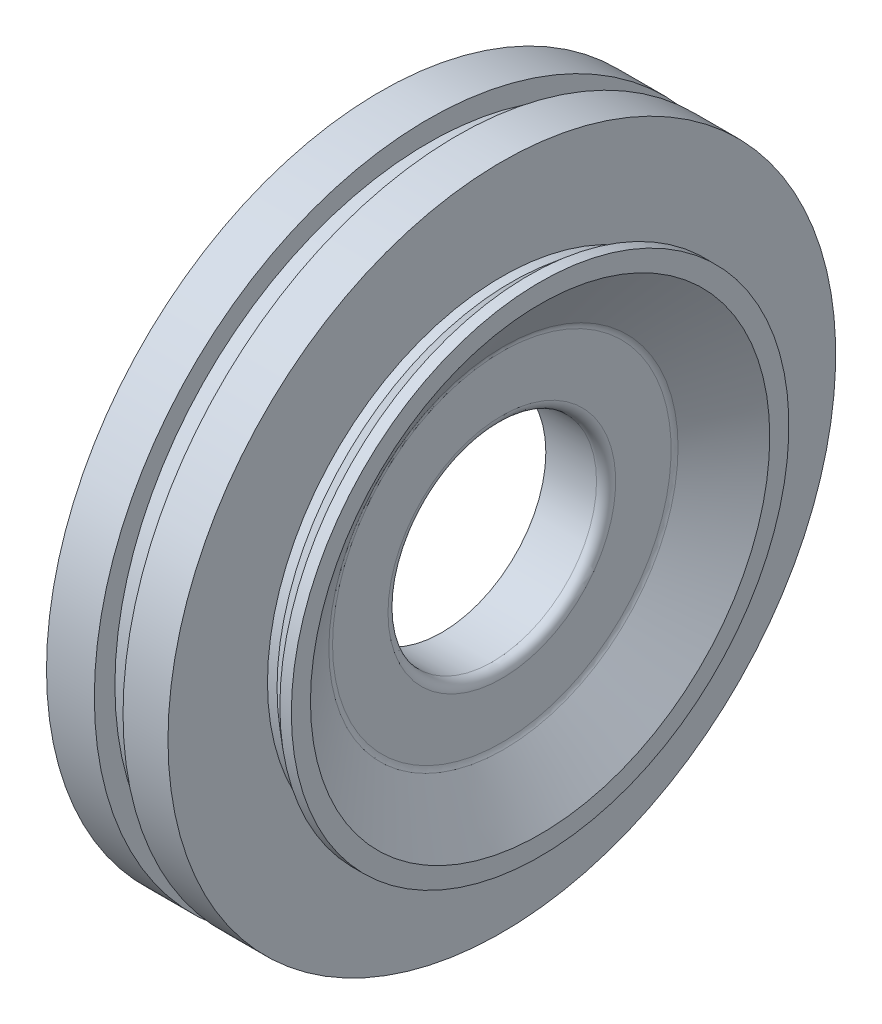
from build123d import *

# Parameters (mm, degrees)
FILLET1_R = 1


with BuildPart() as part:
    # Sketch1 → Revolve1 (revolve)
    with BuildSketch(Plane.XY, mode=Mode.PRIVATE) as revolve1_sk:
        with BuildLine():
            Line((1.237928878, 27.566017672), (1.237928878, 34.9))
            Line((1.237928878, 34.9), (6.237928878, 34.9))
            Line((6.237928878, 34.9), (6.237928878, 32.75))
            Line((6.237928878, 32.75), (9.237928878, 32.75))
            Line((9.237928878, 32.75), (9.237928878, 34.9))
            Line((9.237928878, 34.9), (13.937928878, 34.9))
            Line((13.937928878, 34.9), (13.937928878, 24.5))
            Line((13.937928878, 24.5), (14.937928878, 24.5))
            Line((14.937928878, 24.5), (16.737928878, 26.006418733))
            Line((16.737928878, 26.006418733), (17.937928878, 26.006418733))
            Line((17.937928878, 26.006418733), (17.937928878, 24.006418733))
            Line((17.937928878, 24.006418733), (13.937928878, 18))
            Line((13.937928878, 18), (13.937928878, 10.9))
            Line((13.937928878, 10.9), (7.637928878, 10.9))
            Line((7.637928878, 10.9), (7.637928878, 14.5))
            Line((7.637928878, 14.5), (6.837928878, 14.5))
            Line((6.837928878, 14.5), (6.837928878, 16.678511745))
            ThreePointArc((6.837928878, 16.678511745), (6.959441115, 17.00523336), (7.264916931, 17.173152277))
            Line((7.264916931, 17.173152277), (9.367714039, 17.4835379))
            ThreePointArc((9.367714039, 17.4835379), (9.665698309, 17.642974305), (9.794189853, 17.95555152))
            Line((9.794189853, 17.95555152), (10.095992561, 24.617828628))
            ThreePointArc((10.095992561, 24.617828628), (9.58173396, 26.049476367), (8.209130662, 26.705248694))
            Line((8.209130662, 26.705248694), (1.710156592, 27.066789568))
            ThreePointArc((1.710156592, 27.066789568), (1.374689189, 27.222423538), (1.237928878, 27.566017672))
        make_face()
    revolve(revolve1_sk.sketch.rotate(Axis((0, 0, 0), (1, 0, 0)), 90), axis=Axis((0, 0, 0), (1, 0, 0)))

    # Fillet1
    fillet1_edges = [part.edges().sort_by_distance(p)[0] for p in [
        (13.937928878, 0, -18),
        (13.937928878, 0, -10.9),
    ]]
    fillet(fillet1_edges, radius=FILLET1_R)


solid = part.part
